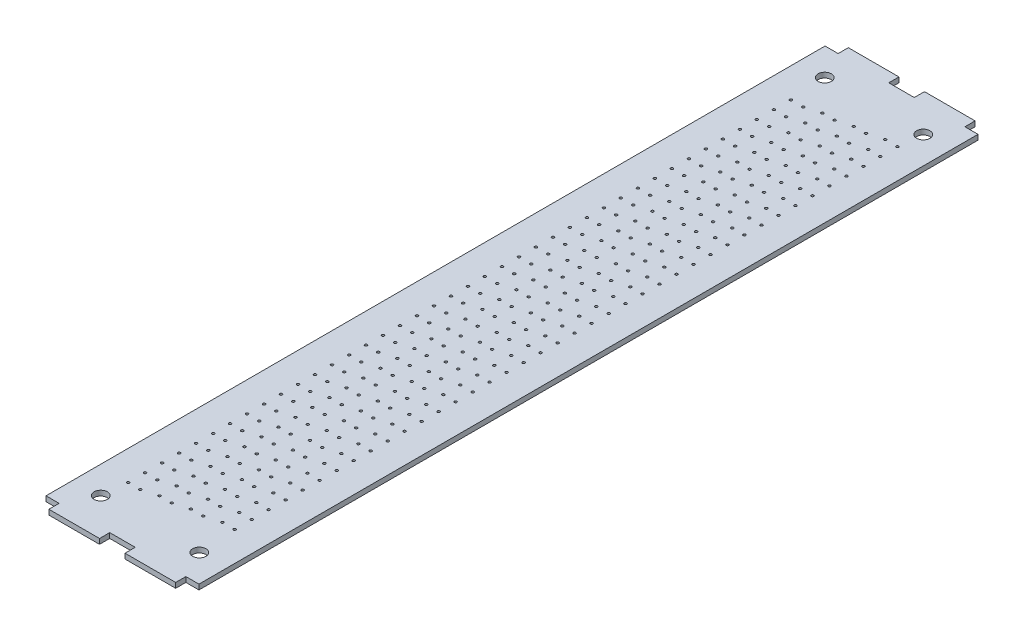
from build123d import *

# Parameters (mm, degrees)
CROQUIS1_R              = 3.9
CROQUIS1_R_2            = 0.75
SALIENTE_EXTRUIR1_DEPTH = 3


with BuildPart() as part:
    # Croquis1 → Saliente-Extruir1 (new body)
    with BuildSketch(Plane(origin=(0, 0, 0), x_dir=(1, 0, 0), z_dir=(0, 1, 0))):
        Polygon((0, 0), (7.7, 0), (7.7, -6), (37.5, -6), (37.5, 0), (52.5, 0), (52.5, -6), (82.3, -6), (82.3, 0), (90, 0), (90, 458.4), (82.3, 458.4), (82.3, 464.4), (52.5, 464.4), (52.5, 458.4), (37.5, 458.4), (37.5, 464.4), (7.7, 464.4), (7.7, 458.4), (0, 458.4), align=None)
        with Locations(Location((16, 442.2, 0), (0, 0, 270))):
            Circle(CROQUIS1_R, mode=Mode.SUBTRACT)
        with Locations(Location((74, 442.2, 0), (0, 0, 270))):
            Circle(CROQUIS1_R, mode=Mode.SUBTRACT)
        with Locations(Location((16, 16.2, 0), (0, 0, 270))):
            Circle(CROQUIS1_R, mode=Mode.SUBTRACT)
        with Locations(Location((74, 16.2, 0), (0, 0, 270))):
            Circle(CROQUIS1_R, mode=Mode.SUBTRACT)
        with Locations(Location((72.6, 38.4, 0), (0, 0, 270))):
            Circle(CROQUIS1_R_2, mode=Mode.SUBTRACT)
        with Locations(Location((65.4, 38.4, 0), (0, 0, 270))):
            Circle(CROQUIS1_R_2, mode=Mode.SUBTRACT)
        with Locations(Location((56.6, 35.9, 0), (0, 0, 270))):
            Circle(CROQUIS1_R_2, mode=Mode.SUBTRACT)
        with Locations(Location((49.4, 35.9, 0), (0, 0, 270))):
            Circle(CROQUIS1_R_2, mode=Mode.SUBTRACT)
        with Locations(Location((40.6, 33.4, 0), (0, 0, 270))):
            Circle(CROQUIS1_R_2, mode=Mode.SUBTRACT)
        with Locations(Location((33.4, 33.4, 0), (0, 0, 270))):
            Circle(CROQUIS1_R_2, mode=Mode.SUBTRACT)
        with Locations(Location((24.6, 30.9, 0), (0, 0, 270))):
            Circle(CROQUIS1_R_2, mode=Mode.SUBTRACT)
        with Locations(Location((17.4, 30.9, 0), (0, 0, 270))):
            Circle(CROQUIS1_R_2, mode=Mode.SUBTRACT)
        with Locations(Location((17.4, 40.9, 0), (0, 0, 270))):
            Circle(CROQUIS1_R_2, mode=Mode.SUBTRACT)
        with Locations(Location((24.6, 40.9, 0), (0, 0, 270))):
            Circle(CROQUIS1_R_2, mode=Mode.SUBTRACT)
        with Locations(Location((33.4, 43.4, 0), (0, 0, 270))):
            Circle(CROQUIS1_R_2, mode=Mode.SUBTRACT)
        with Locations(Location((40.6, 43.4, 0), (0, 0, 270))):
            Circle(CROQUIS1_R_2, mode=Mode.SUBTRACT)
        with Locations(Location((49.4, 45.9, 0), (0, 0, 270))):
            Circle(CROQUIS1_R_2, mode=Mode.SUBTRACT)
        with Locations(Location((56.6, 45.9, 0), (0, 0, 270))):
            Circle(CROQUIS1_R_2, mode=Mode.SUBTRACT)
        with Locations(Location((65.4, 48.4, 0), (0, 0, 270))):
            Circle(CROQUIS1_R_2, mode=Mode.SUBTRACT)
        with Locations(Location((72.6, 48.4, 0), (0, 0, 270))):
            Circle(CROQUIS1_R_2, mode=Mode.SUBTRACT)
        with Locations(Location((17.4, 50.9, 0), (0, 0, 270))):
            Circle(CROQUIS1_R_2, mode=Mode.SUBTRACT)
        with Locations(Location((24.6, 50.9, 0), (0, 0, 270))):
            Circle(CROQUIS1_R_2, mode=Mode.SUBTRACT)
        with Locations(Location((33.4, 53.4, 0), (0, 0, 270))):
            Circle(CROQUIS1_R_2, mode=Mode.SUBTRACT)
        with Locations(Location((40.6, 53.4, 0), (0, 0, 270))):
            Circle(CROQUIS1_R_2, mode=Mode.SUBTRACT)
        with Locations(Location((49.4, 55.9, 0), (0, 0, 270))):
            Circle(CROQUIS1_R_2, mode=Mode.SUBTRACT)
        with Locations(Location((56.6, 55.9, 0), (0, 0, 270))):
            Circle(CROQUIS1_R_2, mode=Mode.SUBTRACT)
        with Locations(Location((65.4, 58.4, 0), (0, 0, 270))):
            Circle(CROQUIS1_R_2, mode=Mode.SUBTRACT)
        with Locations(Location((72.6, 58.4, 0), (0, 0, 270))):
            Circle(CROQUIS1_R_2, mode=Mode.SUBTRACT)
        with Locations(Location((17.4, 60.9, 0), (0, 0, 270))):
            Circle(CROQUIS1_R_2, mode=Mode.SUBTRACT)
        with Locations(Location((24.6, 60.9, 0), (0, 0, 270))):
            Circle(CROQUIS1_R_2, mode=Mode.SUBTRACT)
        with Locations(Location((33.4, 63.4, 0), (0, 0, 270))):
            Circle(CROQUIS1_R_2, mode=Mode.SUBTRACT)
        with Locations(Location((40.6, 63.4, 0), (0, 0, 270))):
            Circle(CROQUIS1_R_2, mode=Mode.SUBTRACT)
        with Locations(Location((49.4, 65.9, 0), (0, 0, 270))):
            Circle(CROQUIS1_R_2, mode=Mode.SUBTRACT)
        with Locations(Location((56.6, 65.9, 0), (0, 0, 270))):
            Circle(CROQUIS1_R_2, mode=Mode.SUBTRACT)
        with Locations(Location((65.4, 68.4, 0), (0, 0, 270))):
            Circle(CROQUIS1_R_2, mode=Mode.SUBTRACT)
        with Locations(Location((72.6, 68.4, 0), (0, 0, 270))):
            Circle(CROQUIS1_R_2, mode=Mode.SUBTRACT)
        with Locations(Location((17.4, 70.9, 0), (0, 0, 270))):
            Circle(CROQUIS1_R_2, mode=Mode.SUBTRACT)
        with Locations(Location((24.6, 70.9, 0), (0, 0, 270))):
            Circle(CROQUIS1_R_2, mode=Mode.SUBTRACT)
        with Locations(Location((33.4, 73.4, 0), (0, 0, 270))):
            Circle(CROQUIS1_R_2, mode=Mode.SUBTRACT)
        with Locations(Location((40.6, 73.4, 0), (0, 0, 270))):
            Circle(CROQUIS1_R_2, mode=Mode.SUBTRACT)
        with Locations(Location((49.4, 75.9, 0), (0, 0, 270))):
            Circle(CROQUIS1_R_2, mode=Mode.SUBTRACT)
        with Locations(Location((56.6, 75.9, 0), (0, 0, 270))):
            Circle(CROQUIS1_R_2, mode=Mode.SUBTRACT)
        with Locations(Location((65.4, 78.4, 0), (0, 0, 270))):
            Circle(CROQUIS1_R_2, mode=Mode.SUBTRACT)
        with Locations(Location((72.6, 78.4, 0), (0, 0, 270))):
            Circle(CROQUIS1_R_2, mode=Mode.SUBTRACT)
        with Locations(Location((17.4, 80.9, 0), (0, 0, 270))):
            Circle(CROQUIS1_R_2, mode=Mode.SUBTRACT)
        with Locations(Location((24.6, 80.9, 0), (0, 0, 270))):
            Circle(CROQUIS1_R_2, mode=Mode.SUBTRACT)
        with Locations(Location((33.4, 83.4, 0), (0, 0, 270))):
            Circle(CROQUIS1_R_2, mode=Mode.SUBTRACT)
        with Locations(Location((40.6, 83.4, 0), (0, 0, 270))):
            Circle(CROQUIS1_R_2, mode=Mode.SUBTRACT)
        with Locations(Location((49.4, 85.9, 0), (0, 0, 270))):
            Circle(CROQUIS1_R_2, mode=Mode.SUBTRACT)
        with Locations(Location((56.6, 85.9, 0), (0, 0, 270))):
            Circle(CROQUIS1_R_2, mode=Mode.SUBTRACT)
        with Locations(Location((65.4, 88.4, 0), (0, 0, 270))):
            Circle(CROQUIS1_R_2, mode=Mode.SUBTRACT)
        with Locations(Location((72.6, 88.4, 0), (0, 0, 270))):
            Circle(CROQUIS1_R_2, mode=Mode.SUBTRACT)
        with Locations(Location((17.4, 90.9, 0), (0, 0, 270))):
            Circle(CROQUIS1_R_2, mode=Mode.SUBTRACT)
        with Locations(Location((24.6, 90.9, 0), (0, 0, 270))):
            Circle(CROQUIS1_R_2, mode=Mode.SUBTRACT)
        with Locations(Location((33.4, 93.4, 0), (0, 0, 270))):
            Circle(CROQUIS1_R_2, mode=Mode.SUBTRACT)
        with Locations(Location((40.6, 93.4, 0), (0, 0, 270))):
            Circle(CROQUIS1_R_2, mode=Mode.SUBTRACT)
        with Locations(Location((49.4, 95.9, 0), (0, 0, 270))):
            Circle(CROQUIS1_R_2, mode=Mode.SUBTRACT)
        with Locations(Location((56.6, 95.9, 0), (0, 0, 270))):
            Circle(CROQUIS1_R_2, mode=Mode.SUBTRACT)
        with Locations(Location((65.4, 98.4, 0), (0, 0, 270))):
            Circle(CROQUIS1_R_2, mode=Mode.SUBTRACT)
        with Locations(Location((72.6, 98.4, 0), (0, 0, 270))):
            Circle(CROQUIS1_R_2, mode=Mode.SUBTRACT)
        with Locations(Location((17.4, 100.9, 0), (0, 0, 270))):
            Circle(CROQUIS1_R_2, mode=Mode.SUBTRACT)
        with Locations(Location((24.6, 100.9, 0), (0, 0, 270))):
            Circle(CROQUIS1_R_2, mode=Mode.SUBTRACT)
        with Locations(Location((33.4, 103.4, 0), (0, 0, 270))):
            Circle(CROQUIS1_R_2, mode=Mode.SUBTRACT)
        with Locations(Location((40.6, 103.4, 0), (0, 0, 270))):
            Circle(CROQUIS1_R_2, mode=Mode.SUBTRACT)
        with Locations(Location((49.4, 105.9, 0), (0, 0, 270))):
            Circle(CROQUIS1_R_2, mode=Mode.SUBTRACT)
        with Locations(Location((56.6, 105.9, 0), (0, 0, 270))):
            Circle(CROQUIS1_R_2, mode=Mode.SUBTRACT)
        with Locations(Location((65.4, 108.4, 0), (0, 0, 270))):
            Circle(CROQUIS1_R_2, mode=Mode.SUBTRACT)
        with Locations(Location((72.6, 108.4, 0), (0, 0, 270))):
            Circle(CROQUIS1_R_2, mode=Mode.SUBTRACT)
        with Locations(Location((17.4, 110.9, 0), (0, 0, 270))):
            Circle(CROQUIS1_R_2, mode=Mode.SUBTRACT)
        with Locations(Location((24.6, 110.9, 0), (0, 0, 270))):
            Circle(CROQUIS1_R_2, mode=Mode.SUBTRACT)
        with Locations(Location((33.4, 113.4, 0), (0, 0, 270))):
            Circle(CROQUIS1_R_2, mode=Mode.SUBTRACT)
        with Locations(Location((40.6, 113.4, 0), (0, 0, 270))):
            Circle(CROQUIS1_R_2, mode=Mode.SUBTRACT)
        with Locations(Location((49.4, 115.9, 0), (0, 0, 270))):
            Circle(CROQUIS1_R_2, mode=Mode.SUBTRACT)
        with Locations(Location((56.6, 115.9, 0), (0, 0, 270))):
            Circle(CROQUIS1_R_2, mode=Mode.SUBTRACT)
        with Locations(Location((65.4, 118.4, 0), (0, 0, 270))):
            Circle(CROQUIS1_R_2, mode=Mode.SUBTRACT)
        with Locations(Location((72.6, 118.4, 0), (0, 0, 270))):
            Circle(CROQUIS1_R_2, mode=Mode.SUBTRACT)
        with Locations(Location((17.4, 120.9, 0), (0, 0, 270))):
            Circle(CROQUIS1_R_2, mode=Mode.SUBTRACT)
        with Locations(Location((24.6, 120.9, 0), (0, 0, 270))):
            Circle(CROQUIS1_R_2, mode=Mode.SUBTRACT)
        with Locations(Location((33.4, 123.4, 0), (0, 0, 270))):
            Circle(CROQUIS1_R_2, mode=Mode.SUBTRACT)
        with Locations(Location((40.6, 123.4, 0), (0, 0, 270))):
            Circle(CROQUIS1_R_2, mode=Mode.SUBTRACT)
        with Locations(Location((49.4, 125.9, 0), (0, 0, 270))):
            Circle(CROQUIS1_R_2, mode=Mode.SUBTRACT)
        with Locations(Location((56.6, 125.9, 0), (0, 0, 270))):
            Circle(CROQUIS1_R_2, mode=Mode.SUBTRACT)
        with Locations(Location((65.4, 128.4, 0), (0, 0, 270))):
            Circle(CROQUIS1_R_2, mode=Mode.SUBTRACT)
        with Locations(Location((72.6, 128.4, 0), (0, 0, 270))):
            Circle(CROQUIS1_R_2, mode=Mode.SUBTRACT)
        with Locations(Location((17.4, 130.9, 0), (0, 0, 270))):
            Circle(CROQUIS1_R_2, mode=Mode.SUBTRACT)
        with Locations(Location((24.6, 130.9, 0), (0, 0, 270))):
            Circle(CROQUIS1_R_2, mode=Mode.SUBTRACT)
        with Locations(Location((33.4, 133.4, 0), (0, 0, 270))):
            Circle(CROQUIS1_R_2, mode=Mode.SUBTRACT)
        with Locations(Location((40.6, 133.4, 0), (0, 0, 270))):
            Circle(CROQUIS1_R_2, mode=Mode.SUBTRACT)
        with Locations(Location((49.4, 135.9, 0), (0, 0, 270))):
            Circle(CROQUIS1_R_2, mode=Mode.SUBTRACT)
        with Locations(Location((56.6, 135.9, 0), (0, 0, 270))):
            Circle(CROQUIS1_R_2, mode=Mode.SUBTRACT)
        with Locations(Location((65.4, 138.4, 0), (0, 0, 270))):
            Circle(CROQUIS1_R_2, mode=Mode.SUBTRACT)
        with Locations(Location((72.6, 138.4, 0), (0, 0, 270))):
            Circle(CROQUIS1_R_2, mode=Mode.SUBTRACT)
        with Locations(Location((17.4, 140.9, 0), (0, 0, 270))):
            Circle(CROQUIS1_R_2, mode=Mode.SUBTRACT)
        with Locations(Location((24.6, 140.9, 0), (0, 0, 270))):
            Circle(CROQUIS1_R_2, mode=Mode.SUBTRACT)
        with Locations(Location((33.4, 143.4, 0), (0, 0, 270))):
            Circle(CROQUIS1_R_2, mode=Mode.SUBTRACT)
        with Locations(Location((40.6, 143.4, 0), (0, 0, 270))):
            Circle(CROQUIS1_R_2, mode=Mode.SUBTRACT)
        with Locations(Location((49.4, 145.9, 0), (0, 0, 270))):
            Circle(CROQUIS1_R_2, mode=Mode.SUBTRACT)
        with Locations(Location((56.6, 145.9, 0), (0, 0, 270))):
            Circle(CROQUIS1_R_2, mode=Mode.SUBTRACT)
        with Locations(Location((65.4, 148.4, 0), (0, 0, 270))):
            Circle(CROQUIS1_R_2, mode=Mode.SUBTRACT)
        with Locations(Location((72.6, 148.4, 0), (0, 0, 270))):
            Circle(CROQUIS1_R_2, mode=Mode.SUBTRACT)
        with Locations(Location((17.4, 150.9, 0), (0, 0, 270))):
            Circle(CROQUIS1_R_2, mode=Mode.SUBTRACT)
        with Locations(Location((24.6, 150.9, 0), (0, 0, 270))):
            Circle(CROQUIS1_R_2, mode=Mode.SUBTRACT)
        with Locations(Location((33.4, 153.4, 0), (0, 0, 270))):
            Circle(CROQUIS1_R_2, mode=Mode.SUBTRACT)
        with Locations(Location((40.6, 153.4, 0), (0, 0, 270))):
            Circle(CROQUIS1_R_2, mode=Mode.SUBTRACT)
        with Locations(Location((49.4, 155.9, 0), (0, 0, 270))):
            Circle(CROQUIS1_R_2, mode=Mode.SUBTRACT)
        with Locations(Location((56.6, 155.9, 0), (0, 0, 270))):
            Circle(CROQUIS1_R_2, mode=Mode.SUBTRACT)
        with Locations(Location((65.4, 158.4, 0), (0, 0, 270))):
            Circle(CROQUIS1_R_2, mode=Mode.SUBTRACT)
        with Locations(Location((72.6, 158.4, 0), (0, 0, 270))):
            Circle(CROQUIS1_R_2, mode=Mode.SUBTRACT)
        with Locations(Location((17.4, 160.9, 0), (0, 0, 270))):
            Circle(CROQUIS1_R_2, mode=Mode.SUBTRACT)
        with Locations(Location((24.6, 160.9, 0), (0, 0, 270))):
            Circle(CROQUIS1_R_2, mode=Mode.SUBTRACT)
        with Locations(Location((33.4, 163.4, 0), (0, 0, 270))):
            Circle(CROQUIS1_R_2, mode=Mode.SUBTRACT)
        with Locations(Location((40.6, 163.4, 0), (0, 0, 270))):
            Circle(CROQUIS1_R_2, mode=Mode.SUBTRACT)
        with Locations(Location((49.4, 165.9, 0), (0, 0, 270))):
            Circle(CROQUIS1_R_2, mode=Mode.SUBTRACT)
        with Locations(Location((56.6, 165.9, 0), (0, 0, 270))):
            Circle(CROQUIS1_R_2, mode=Mode.SUBTRACT)
        with Locations(Location((65.4, 168.4, 0), (0, 0, 270))):
            Circle(CROQUIS1_R_2, mode=Mode.SUBTRACT)
        with Locations(Location((72.6, 168.4, 0), (0, 0, 270))):
            Circle(CROQUIS1_R_2, mode=Mode.SUBTRACT)
        with Locations(Location((17.4, 170.9, 0), (0, 0, 270))):
            Circle(CROQUIS1_R_2, mode=Mode.SUBTRACT)
        with Locations(Location((24.6, 170.9, 0), (0, 0, 270))):
            Circle(CROQUIS1_R_2, mode=Mode.SUBTRACT)
        with Locations(Location((33.4, 173.4, 0), (0, 0, 270))):
            Circle(CROQUIS1_R_2, mode=Mode.SUBTRACT)
        with Locations(Location((40.6, 173.4, 0), (0, 0, 270))):
            Circle(CROQUIS1_R_2, mode=Mode.SUBTRACT)
        with Locations(Location((49.4, 175.9, 0), (0, 0, 270))):
            Circle(CROQUIS1_R_2, mode=Mode.SUBTRACT)
        with Locations(Location((56.6, 175.9, 0), (0, 0, 270))):
            Circle(CROQUIS1_R_2, mode=Mode.SUBTRACT)
        with Locations(Location((65.4, 178.4, 0), (0, 0, 270))):
            Circle(CROQUIS1_R_2, mode=Mode.SUBTRACT)
        with Locations(Location((72.6, 178.4, 0), (0, 0, 270))):
            Circle(CROQUIS1_R_2, mode=Mode.SUBTRACT)
        with Locations(Location((17.4, 180.9, 0), (0, 0, 270))):
            Circle(CROQUIS1_R_2, mode=Mode.SUBTRACT)
        with Locations(Location((24.6, 180.9, 0), (0, 0, 270))):
            Circle(CROQUIS1_R_2, mode=Mode.SUBTRACT)
        with Locations(Location((33.4, 183.4, 0), (0, 0, 270))):
            Circle(CROQUIS1_R_2, mode=Mode.SUBTRACT)
        with Locations(Location((40.6, 183.4, 0), (0, 0, 270))):
            Circle(CROQUIS1_R_2, mode=Mode.SUBTRACT)
        with Locations(Location((49.4, 185.9, 0), (0, 0, 270))):
            Circle(CROQUIS1_R_2, mode=Mode.SUBTRACT)
        with Locations(Location((56.6, 185.9, 0), (0, 0, 270))):
            Circle(CROQUIS1_R_2, mode=Mode.SUBTRACT)
        with Locations(Location((65.4, 188.4, 0), (0, 0, 270))):
            Circle(CROQUIS1_R_2, mode=Mode.SUBTRACT)
        with Locations(Location((72.6, 188.4, 0), (0, 0, 270))):
            Circle(CROQUIS1_R_2, mode=Mode.SUBTRACT)
        with Locations(Location((17.4, 190.9, 0), (0, 0, 270))):
            Circle(CROQUIS1_R_2, mode=Mode.SUBTRACT)
        with Locations(Location((24.6, 190.9, 0), (0, 0, 270))):
            Circle(CROQUIS1_R_2, mode=Mode.SUBTRACT)
        with Locations(Location((33.4, 193.4, 0), (0, 0, 270))):
            Circle(CROQUIS1_R_2, mode=Mode.SUBTRACT)
        with Locations(Location((40.6, 193.4, 0), (0, 0, 270))):
            Circle(CROQUIS1_R_2, mode=Mode.SUBTRACT)
        with Locations(Location((49.4, 195.9, 0), (0, 0, 270))):
            Circle(CROQUIS1_R_2, mode=Mode.SUBTRACT)
        with Locations(Location((56.6, 195.9, 0), (0, 0, 270))):
            Circle(CROQUIS1_R_2, mode=Mode.SUBTRACT)
        with Locations(Location((65.4, 198.4, 0), (0, 0, 270))):
            Circle(CROQUIS1_R_2, mode=Mode.SUBTRACT)
        with Locations(Location((72.6, 198.4, 0), (0, 0, 270))):
            Circle(CROQUIS1_R_2, mode=Mode.SUBTRACT)
        with Locations(Location((17.4, 200.9, 0), (0, 0, 270))):
            Circle(CROQUIS1_R_2, mode=Mode.SUBTRACT)
        with Locations(Location((24.6, 200.9, 0), (0, 0, 270))):
            Circle(CROQUIS1_R_2, mode=Mode.SUBTRACT)
        with Locations(Location((33.4, 203.4, 0), (0, 0, 270))):
            Circle(CROQUIS1_R_2, mode=Mode.SUBTRACT)
        with Locations(Location((40.6, 203.4, 0), (0, 0, 270))):
            Circle(CROQUIS1_R_2, mode=Mode.SUBTRACT)
        with Locations(Location((49.4, 205.9, 0), (0, 0, 270))):
            Circle(CROQUIS1_R_2, mode=Mode.SUBTRACT)
        with Locations(Location((56.6, 205.9, 0), (0, 0, 270))):
            Circle(CROQUIS1_R_2, mode=Mode.SUBTRACT)
        with Locations(Location((65.4, 208.4, 0), (0, 0, 270))):
            Circle(CROQUIS1_R_2, mode=Mode.SUBTRACT)
        with Locations(Location((72.6, 208.4, 0), (0, 0, 270))):
            Circle(CROQUIS1_R_2, mode=Mode.SUBTRACT)
        with Locations(Location((17.4, 210.9, 0), (0, 0, 270))):
            Circle(CROQUIS1_R_2, mode=Mode.SUBTRACT)
        with Locations(Location((24.6, 210.9, 0), (0, 0, 270))):
            Circle(CROQUIS1_R_2, mode=Mode.SUBTRACT)
        with Locations(Location((33.4, 213.4, 0), (0, 0, 270))):
            Circle(CROQUIS1_R_2, mode=Mode.SUBTRACT)
        with Locations(Location((40.6, 213.4, 0), (0, 0, 270))):
            Circle(CROQUIS1_R_2, mode=Mode.SUBTRACT)
        with Locations(Location((49.4, 215.9, 0), (0, 0, 270))):
            Circle(CROQUIS1_R_2, mode=Mode.SUBTRACT)
        with Locations(Location((56.6, 215.9, 0), (0, 0, 270))):
            Circle(CROQUIS1_R_2, mode=Mode.SUBTRACT)
        with Locations(Location((65.4, 218.4, 0), (0, 0, 270))):
            Circle(CROQUIS1_R_2, mode=Mode.SUBTRACT)
        with Locations(Location((72.6, 218.4, 0), (0, 0, 270))):
            Circle(CROQUIS1_R_2, mode=Mode.SUBTRACT)
        with Locations(Location((17.4, 220.9, 0), (0, 0, 270))):
            Circle(CROQUIS1_R_2, mode=Mode.SUBTRACT)
        with Locations(Location((24.6, 220.9, 0), (0, 0, 270))):
            Circle(CROQUIS1_R_2, mode=Mode.SUBTRACT)
        with Locations(Location((33.4, 223.4, 0), (0, 0, 270))):
            Circle(CROQUIS1_R_2, mode=Mode.SUBTRACT)
        with Locations(Location((40.6, 223.4, 0), (0, 0, 270))):
            Circle(CROQUIS1_R_2, mode=Mode.SUBTRACT)
        with Locations(Location((49.4, 225.9, 0), (0, 0, 270))):
            Circle(CROQUIS1_R_2, mode=Mode.SUBTRACT)
        with Locations(Location((56.6, 225.9, 0), (0, 0, 270))):
            Circle(CROQUIS1_R_2, mode=Mode.SUBTRACT)
        with Locations(Location((65.4, 228.4, 0), (0, 0, 270))):
            Circle(CROQUIS1_R_2, mode=Mode.SUBTRACT)
        with Locations(Location((72.6, 228.4, 0), (0, 0, 270))):
            Circle(CROQUIS1_R_2, mode=Mode.SUBTRACT)
        with Locations(Location((17.4, 230.9, 0), (0, 0, 270))):
            Circle(CROQUIS1_R_2, mode=Mode.SUBTRACT)
        with Locations(Location((24.6, 230.9, 0), (0, 0, 270))):
            Circle(CROQUIS1_R_2, mode=Mode.SUBTRACT)
        with Locations(Location((33.4, 233.4, 0), (0, 0, 270))):
            Circle(CROQUIS1_R_2, mode=Mode.SUBTRACT)
        with Locations(Location((40.6, 233.4, 0), (0, 0, 270))):
            Circle(CROQUIS1_R_2, mode=Mode.SUBTRACT)
        with Locations(Location((49.4, 235.9, 0), (0, 0, 270))):
            Circle(CROQUIS1_R_2, mode=Mode.SUBTRACT)
        with Locations(Location((56.6, 235.9, 0), (0, 0, 270))):
            Circle(CROQUIS1_R_2, mode=Mode.SUBTRACT)
        with Locations(Location((65.4, 238.4, 0), (0, 0, 270))):
            Circle(CROQUIS1_R_2, mode=Mode.SUBTRACT)
        with Locations(Location((72.6, 238.4, 0), (0, 0, 270))):
            Circle(CROQUIS1_R_2, mode=Mode.SUBTRACT)
        with Locations(Location((17.4, 240.9, 0), (0, 0, 270))):
            Circle(CROQUIS1_R_2, mode=Mode.SUBTRACT)
        with Locations(Location((24.6, 240.9, 0), (0, 0, 270))):
            Circle(CROQUIS1_R_2, mode=Mode.SUBTRACT)
        with Locations(Location((33.4, 243.4, 0), (0, 0, 270))):
            Circle(CROQUIS1_R_2, mode=Mode.SUBTRACT)
        with Locations(Location((40.6, 243.4, 0), (0, 0, 270))):
            Circle(CROQUIS1_R_2, mode=Mode.SUBTRACT)
        with Locations(Location((49.4, 245.9, 0), (0, 0, 270))):
            Circle(CROQUIS1_R_2, mode=Mode.SUBTRACT)
        with Locations(Location((56.6, 245.9, 0), (0, 0, 270))):
            Circle(CROQUIS1_R_2, mode=Mode.SUBTRACT)
        with Locations(Location((65.4, 248.4, 0), (0, 0, 270))):
            Circle(CROQUIS1_R_2, mode=Mode.SUBTRACT)
        with Locations(Location((72.6, 248.4, 0), (0, 0, 270))):
            Circle(CROQUIS1_R_2, mode=Mode.SUBTRACT)
        with Locations(Location((17.4, 250.9, 0), (0, 0, 270))):
            Circle(CROQUIS1_R_2, mode=Mode.SUBTRACT)
        with Locations(Location((24.6, 250.9, 0), (0, 0, 270))):
            Circle(CROQUIS1_R_2, mode=Mode.SUBTRACT)
        with Locations(Location((33.4, 253.4, 0), (0, 0, 270))):
            Circle(CROQUIS1_R_2, mode=Mode.SUBTRACT)
        with Locations(Location((40.6, 253.4, 0), (0, 0, 270))):
            Circle(CROQUIS1_R_2, mode=Mode.SUBTRACT)
        with Locations(Location((49.4, 255.9, 0), (0, 0, 270))):
            Circle(CROQUIS1_R_2, mode=Mode.SUBTRACT)
        with Locations(Location((56.6, 255.9, 0), (0, 0, 270))):
            Circle(CROQUIS1_R_2, mode=Mode.SUBTRACT)
        with Locations(Location((65.4, 258.4, 0), (0, 0, 270))):
            Circle(CROQUIS1_R_2, mode=Mode.SUBTRACT)
        with Locations(Location((72.6, 258.4, 0), (0, 0, 270))):
            Circle(CROQUIS1_R_2, mode=Mode.SUBTRACT)
        with Locations(Location((17.4, 260.9, 0), (0, 0, 270))):
            Circle(CROQUIS1_R_2, mode=Mode.SUBTRACT)
        with Locations(Location((24.6, 260.9, 0), (0, 0, 270))):
            Circle(CROQUIS1_R_2, mode=Mode.SUBTRACT)
        with Locations(Location((33.4, 263.4, 0), (0, 0, 270))):
            Circle(CROQUIS1_R_2, mode=Mode.SUBTRACT)
        with Locations(Location((40.6, 263.4, 0), (0, 0, 270))):
            Circle(CROQUIS1_R_2, mode=Mode.SUBTRACT)
        with Locations(Location((49.4, 265.9, 0), (0, 0, 270))):
            Circle(CROQUIS1_R_2, mode=Mode.SUBTRACT)
        with Locations(Location((56.6, 265.9, 0), (0, 0, 270))):
            Circle(CROQUIS1_R_2, mode=Mode.SUBTRACT)
        with Locations(Location((65.4, 268.4, 0), (0, 0, 270))):
            Circle(CROQUIS1_R_2, mode=Mode.SUBTRACT)
        with Locations(Location((72.6, 268.4, 0), (0, 0, 270))):
            Circle(CROQUIS1_R_2, mode=Mode.SUBTRACT)
        with Locations(Location((17.4, 270.9, 0), (0, 0, 270))):
            Circle(CROQUIS1_R_2, mode=Mode.SUBTRACT)
        with Locations(Location((24.6, 270.9, 0), (0, 0, 270))):
            Circle(CROQUIS1_R_2, mode=Mode.SUBTRACT)
        with Locations(Location((33.4, 273.4, 0), (0, 0, 270))):
            Circle(CROQUIS1_R_2, mode=Mode.SUBTRACT)
        with Locations(Location((40.6, 273.4, 0), (0, 0, 270))):
            Circle(CROQUIS1_R_2, mode=Mode.SUBTRACT)
        with Locations(Location((49.4, 275.9, 0), (0, 0, 270))):
            Circle(CROQUIS1_R_2, mode=Mode.SUBTRACT)
        with Locations(Location((56.6, 275.9, 0), (0, 0, 270))):
            Circle(CROQUIS1_R_2, mode=Mode.SUBTRACT)
        with Locations(Location((65.4, 278.4, 0), (0, 0, 270))):
            Circle(CROQUIS1_R_2, mode=Mode.SUBTRACT)
        with Locations(Location((72.6, 278.4, 0), (0, 0, 270))):
            Circle(CROQUIS1_R_2, mode=Mode.SUBTRACT)
        with Locations(Location((17.4, 280.9, 0), (0, 0, 270))):
            Circle(CROQUIS1_R_2, mode=Mode.SUBTRACT)
        with Locations(Location((24.6, 280.9, 0), (0, 0, 270))):
            Circle(CROQUIS1_R_2, mode=Mode.SUBTRACT)
        with Locations(Location((33.4, 283.4, 0), (0, 0, 270))):
            Circle(CROQUIS1_R_2, mode=Mode.SUBTRACT)
        with Locations(Location((40.6, 283.4, 0), (0, 0, 270))):
            Circle(CROQUIS1_R_2, mode=Mode.SUBTRACT)
        with Locations(Location((49.4, 285.9, 0), (0, 0, 270))):
            Circle(CROQUIS1_R_2, mode=Mode.SUBTRACT)
        with Locations(Location((56.6, 285.9, 0), (0, 0, 270))):
            Circle(CROQUIS1_R_2, mode=Mode.SUBTRACT)
        with Locations(Location((65.4, 288.4, 0), (0, 0, 270))):
            Circle(CROQUIS1_R_2, mode=Mode.SUBTRACT)
        with Locations(Location((72.6, 288.4, 0), (0, 0, 270))):
            Circle(CROQUIS1_R_2, mode=Mode.SUBTRACT)
        with Locations(Location((17.4, 290.9, 0), (0, 0, 270))):
            Circle(CROQUIS1_R_2, mode=Mode.SUBTRACT)
        with Locations(Location((24.6, 290.9, 0), (0, 0, 270))):
            Circle(CROQUIS1_R_2, mode=Mode.SUBTRACT)
        with Locations(Location((33.4, 293.4, 0), (0, 0, 270))):
            Circle(CROQUIS1_R_2, mode=Mode.SUBTRACT)
        with Locations(Location((40.6, 293.4, 0), (0, 0, 270))):
            Circle(CROQUIS1_R_2, mode=Mode.SUBTRACT)
        with Locations(Location((49.4, 295.9, 0), (0, 0, 270))):
            Circle(CROQUIS1_R_2, mode=Mode.SUBTRACT)
        with Locations(Location((56.6, 295.9, 0), (0, 0, 270))):
            Circle(CROQUIS1_R_2, mode=Mode.SUBTRACT)
        with Locations(Location((65.4, 298.4, 0), (0, 0, 270))):
            Circle(CROQUIS1_R_2, mode=Mode.SUBTRACT)
        with Locations(Location((72.6, 298.4, 0), (0, 0, 270))):
            Circle(CROQUIS1_R_2, mode=Mode.SUBTRACT)
        with Locations(Location((17.4, 300.9, 0), (0, 0, 270))):
            Circle(CROQUIS1_R_2, mode=Mode.SUBTRACT)
        with Locations(Location((24.6, 300.9, 0), (0, 0, 270))):
            Circle(CROQUIS1_R_2, mode=Mode.SUBTRACT)
        with Locations(Location((33.4, 303.4, 0), (0, 0, 270))):
            Circle(CROQUIS1_R_2, mode=Mode.SUBTRACT)
        with Locations(Location((40.6, 303.4, 0), (0, 0, 270))):
            Circle(CROQUIS1_R_2, mode=Mode.SUBTRACT)
        with Locations(Location((49.4, 305.9, 0), (0, 0, 270))):
            Circle(CROQUIS1_R_2, mode=Mode.SUBTRACT)
        with Locations(Location((56.6, 305.9, 0), (0, 0, 270))):
            Circle(CROQUIS1_R_2, mode=Mode.SUBTRACT)
        with Locations(Location((65.4, 308.4, 0), (0, 0, 270))):
            Circle(CROQUIS1_R_2, mode=Mode.SUBTRACT)
        with Locations(Location((72.6, 308.4, 0), (0, 0, 270))):
            Circle(CROQUIS1_R_2, mode=Mode.SUBTRACT)
        with Locations(Location((17.4, 310.9, 0), (0, 0, 270))):
            Circle(CROQUIS1_R_2, mode=Mode.SUBTRACT)
        with Locations(Location((24.6, 310.9, 0), (0, 0, 270))):
            Circle(CROQUIS1_R_2, mode=Mode.SUBTRACT)
        with Locations(Location((33.4, 313.4, 0), (0, 0, 270))):
            Circle(CROQUIS1_R_2, mode=Mode.SUBTRACT)
        with Locations(Location((40.6, 313.4, 0), (0, 0, 270))):
            Circle(CROQUIS1_R_2, mode=Mode.SUBTRACT)
        with Locations(Location((49.4, 315.9, 0), (0, 0, 270))):
            Circle(CROQUIS1_R_2, mode=Mode.SUBTRACT)
        with Locations(Location((56.6, 315.9, 0), (0, 0, 270))):
            Circle(CROQUIS1_R_2, mode=Mode.SUBTRACT)
        with Locations(Location((65.4, 318.4, 0), (0, 0, 270))):
            Circle(CROQUIS1_R_2, mode=Mode.SUBTRACT)
        with Locations(Location((72.6, 318.4, 0), (0, 0, 270))):
            Circle(CROQUIS1_R_2, mode=Mode.SUBTRACT)
        with Locations(Location((17.4, 320.9, 0), (0, 0, 270))):
            Circle(CROQUIS1_R_2, mode=Mode.SUBTRACT)
        with Locations(Location((24.6, 320.9, 0), (0, 0, 270))):
            Circle(CROQUIS1_R_2, mode=Mode.SUBTRACT)
        with Locations(Location((33.4, 323.4, 0), (0, 0, 270))):
            Circle(CROQUIS1_R_2, mode=Mode.SUBTRACT)
        with Locations(Location((40.6, 323.4, 0), (0, 0, 270))):
            Circle(CROQUIS1_R_2, mode=Mode.SUBTRACT)
        with Locations(Location((49.4, 325.9, 0), (0, 0, 270))):
            Circle(CROQUIS1_R_2, mode=Mode.SUBTRACT)
        with Locations(Location((56.6, 325.9, 0), (0, 0, 270))):
            Circle(CROQUIS1_R_2, mode=Mode.SUBTRACT)
        with Locations(Location((65.4, 328.4, 0), (0, 0, 270))):
            Circle(CROQUIS1_R_2, mode=Mode.SUBTRACT)
        with Locations(Location((72.6, 328.4, 0), (0, 0, 270))):
            Circle(CROQUIS1_R_2, mode=Mode.SUBTRACT)
        with Locations(Location((17.4, 330.9, 0), (0, 0, 270))):
            Circle(CROQUIS1_R_2, mode=Mode.SUBTRACT)
        with Locations(Location((24.6, 330.9, 0), (0, 0, 270))):
            Circle(CROQUIS1_R_2, mode=Mode.SUBTRACT)
        with Locations(Location((33.4, 333.4, 0), (0, 0, 270))):
            Circle(CROQUIS1_R_2, mode=Mode.SUBTRACT)
        with Locations(Location((40.6, 333.4, 0), (0, 0, 270))):
            Circle(CROQUIS1_R_2, mode=Mode.SUBTRACT)
        with Locations(Location((49.4, 335.9, 0), (0, 0, 270))):
            Circle(CROQUIS1_R_2, mode=Mode.SUBTRACT)
        with Locations(Location((56.6, 335.9, 0), (0, 0, 270))):
            Circle(CROQUIS1_R_2, mode=Mode.SUBTRACT)
        with Locations(Location((65.4, 338.4, 0), (0, 0, 270))):
            Circle(CROQUIS1_R_2, mode=Mode.SUBTRACT)
        with Locations(Location((72.6, 338.4, 0), (0, 0, 270))):
            Circle(CROQUIS1_R_2, mode=Mode.SUBTRACT)
        with Locations(Location((17.4, 340.9, 0), (0, 0, 270))):
            Circle(CROQUIS1_R_2, mode=Mode.SUBTRACT)
        with Locations(Location((24.6, 340.9, 0), (0, 0, 270))):
            Circle(CROQUIS1_R_2, mode=Mode.SUBTRACT)
        with Locations(Location((33.4, 343.4, 0), (0, 0, 270))):
            Circle(CROQUIS1_R_2, mode=Mode.SUBTRACT)
        with Locations(Location((40.6, 343.4, 0), (0, 0, 270))):
            Circle(CROQUIS1_R_2, mode=Mode.SUBTRACT)
        with Locations(Location((49.4, 345.9, 0), (0, 0, 270))):
            Circle(CROQUIS1_R_2, mode=Mode.SUBTRACT)
        with Locations(Location((56.6, 345.9, 0), (0, 0, 270))):
            Circle(CROQUIS1_R_2, mode=Mode.SUBTRACT)
        with Locations(Location((65.4, 348.4, 0), (0, 0, 270))):
            Circle(CROQUIS1_R_2, mode=Mode.SUBTRACT)
        with Locations(Location((72.6, 348.4, 0), (0, 0, 270))):
            Circle(CROQUIS1_R_2, mode=Mode.SUBTRACT)
        with Locations(Location((17.4, 350.9, 0), (0, 0, 270))):
            Circle(CROQUIS1_R_2, mode=Mode.SUBTRACT)
        with Locations(Location((24.6, 350.9, 0), (0, 0, 270))):
            Circle(CROQUIS1_R_2, mode=Mode.SUBTRACT)
        with Locations(Location((33.4, 353.4, 0), (0, 0, 270))):
            Circle(CROQUIS1_R_2, mode=Mode.SUBTRACT)
        with Locations(Location((40.6, 353.4, 0), (0, 0, 270))):
            Circle(CROQUIS1_R_2, mode=Mode.SUBTRACT)
        with Locations(Location((49.4, 355.9, 0), (0, 0, 270))):
            Circle(CROQUIS1_R_2, mode=Mode.SUBTRACT)
        with Locations(Location((56.6, 355.9, 0), (0, 0, 270))):
            Circle(CROQUIS1_R_2, mode=Mode.SUBTRACT)
        with Locations(Location((65.4, 358.4, 0), (0, 0, 270))):
            Circle(CROQUIS1_R_2, mode=Mode.SUBTRACT)
        with Locations(Location((72.6, 358.4, 0), (0, 0, 270))):
            Circle(CROQUIS1_R_2, mode=Mode.SUBTRACT)
        with Locations(Location((17.4, 360.9, 0), (0, 0, 270))):
            Circle(CROQUIS1_R_2, mode=Mode.SUBTRACT)
        with Locations(Location((24.6, 360.9, 0), (0, 0, 270))):
            Circle(CROQUIS1_R_2, mode=Mode.SUBTRACT)
        with Locations(Location((33.4, 363.4, 0), (0, 0, 270))):
            Circle(CROQUIS1_R_2, mode=Mode.SUBTRACT)
        with Locations(Location((40.6, 363.4, 0), (0, 0, 270))):
            Circle(CROQUIS1_R_2, mode=Mode.SUBTRACT)
        with Locations(Location((49.4, 365.9, 0), (0, 0, 270))):
            Circle(CROQUIS1_R_2, mode=Mode.SUBTRACT)
        with Locations(Location((56.6, 365.9, 0), (0, 0, 270))):
            Circle(CROQUIS1_R_2, mode=Mode.SUBTRACT)
        with Locations(Location((65.4, 368.4, 0), (0, 0, 270))):
            Circle(CROQUIS1_R_2, mode=Mode.SUBTRACT)
        with Locations(Location((72.6, 368.4, 0), (0, 0, 270))):
            Circle(CROQUIS1_R_2, mode=Mode.SUBTRACT)
        with Locations(Location((17.4, 370.9, 0), (0, 0, 270))):
            Circle(CROQUIS1_R_2, mode=Mode.SUBTRACT)
        with Locations(Location((24.6, 370.9, 0), (0, 0, 270))):
            Circle(CROQUIS1_R_2, mode=Mode.SUBTRACT)
        with Locations(Location((33.4, 373.4, 0), (0, 0, 270))):
            Circle(CROQUIS1_R_2, mode=Mode.SUBTRACT)
        with Locations(Location((40.6, 373.4, 0), (0, 0, 270))):
            Circle(CROQUIS1_R_2, mode=Mode.SUBTRACT)
        with Locations(Location((49.4, 375.9, 0), (0, 0, 270))):
            Circle(CROQUIS1_R_2, mode=Mode.SUBTRACT)
        with Locations(Location((56.6, 375.9, 0), (0, 0, 270))):
            Circle(CROQUIS1_R_2, mode=Mode.SUBTRACT)
        with Locations(Location((65.4, 378.4, 0), (0, 0, 270))):
            Circle(CROQUIS1_R_2, mode=Mode.SUBTRACT)
        with Locations(Location((72.6, 378.4, 0), (0, 0, 270))):
            Circle(CROQUIS1_R_2, mode=Mode.SUBTRACT)
        with Locations(Location((17.4, 380.9, 0), (0, 0, 270))):
            Circle(CROQUIS1_R_2, mode=Mode.SUBTRACT)
        with Locations(Location((24.6, 380.9, 0), (0, 0, 270))):
            Circle(CROQUIS1_R_2, mode=Mode.SUBTRACT)
        with Locations(Location((33.4, 383.4, 0), (0, 0, 270))):
            Circle(CROQUIS1_R_2, mode=Mode.SUBTRACT)
        with Locations(Location((40.6, 383.4, 0), (0, 0, 270))):
            Circle(CROQUIS1_R_2, mode=Mode.SUBTRACT)
        with Locations(Location((49.4, 385.9, 0), (0, 0, 270))):
            Circle(CROQUIS1_R_2, mode=Mode.SUBTRACT)
        with Locations(Location((56.6, 385.9, 0), (0, 0, 270))):
            Circle(CROQUIS1_R_2, mode=Mode.SUBTRACT)
        with Locations(Location((65.4, 388.4, 0), (0, 0, 270))):
            Circle(CROQUIS1_R_2, mode=Mode.SUBTRACT)
        with Locations(Location((72.6, 388.4, 0), (0, 0, 270))):
            Circle(CROQUIS1_R_2, mode=Mode.SUBTRACT)
        with Locations(Location((17.4, 390.9, 0), (0, 0, 270))):
            Circle(CROQUIS1_R_2, mode=Mode.SUBTRACT)
        with Locations(Location((24.6, 390.9, 0), (0, 0, 270))):
            Circle(CROQUIS1_R_2, mode=Mode.SUBTRACT)
        with Locations(Location((33.4, 393.4, 0), (0, 0, 270))):
            Circle(CROQUIS1_R_2, mode=Mode.SUBTRACT)
        with Locations(Location((40.6, 393.4, 0), (0, 0, 270))):
            Circle(CROQUIS1_R_2, mode=Mode.SUBTRACT)
        with Locations(Location((49.4, 395.9, 0), (0, 0, 270))):
            Circle(CROQUIS1_R_2, mode=Mode.SUBTRACT)
        with Locations(Location((56.6, 395.9, 0), (0, 0, 270))):
            Circle(CROQUIS1_R_2, mode=Mode.SUBTRACT)
        with Locations(Location((65.4, 398.4, 0), (0, 0, 270))):
            Circle(CROQUIS1_R_2, mode=Mode.SUBTRACT)
        with Locations(Location((72.6, 398.4, 0), (0, 0, 270))):
            Circle(CROQUIS1_R_2, mode=Mode.SUBTRACT)
        with Locations(Location((17.4, 400.9, 0), (0, 0, 270))):
            Circle(CROQUIS1_R_2, mode=Mode.SUBTRACT)
        with Locations(Location((24.6, 400.9, 0), (0, 0, 270))):
            Circle(CROQUIS1_R_2, mode=Mode.SUBTRACT)
        with Locations(Location((33.4, 403.4, 0), (0, 0, 270))):
            Circle(CROQUIS1_R_2, mode=Mode.SUBTRACT)
        with Locations(Location((40.6, 403.4, 0), (0, 0, 270))):
            Circle(CROQUIS1_R_2, mode=Mode.SUBTRACT)
        with Locations(Location((49.4, 405.9, 0), (0, 0, 270))):
            Circle(CROQUIS1_R_2, mode=Mode.SUBTRACT)
        with Locations(Location((56.6, 405.9, 0), (0, 0, 270))):
            Circle(CROQUIS1_R_2, mode=Mode.SUBTRACT)
        with Locations(Location((65.4, 408.4, 0), (0, 0, 270))):
            Circle(CROQUIS1_R_2, mode=Mode.SUBTRACT)
        with Locations(Location((72.6, 408.4, 0), (0, 0, 270))):
            Circle(CROQUIS1_R_2, mode=Mode.SUBTRACT)
        with Locations(Location((17.4, 410.9, 0), (0, 0, 270))):
            Circle(CROQUIS1_R_2, mode=Mode.SUBTRACT)
        with Locations(Location((24.6, 410.9, 0), (0, 0, 270))):
            Circle(CROQUIS1_R_2, mode=Mode.SUBTRACT)
        with Locations(Location((33.4, 413.4, 0), (0, 0, 270))):
            Circle(CROQUIS1_R_2, mode=Mode.SUBTRACT)
        with Locations(Location((40.6, 413.4, 0), (0, 0, 270))):
            Circle(CROQUIS1_R_2, mode=Mode.SUBTRACT)
        with Locations(Location((49.4, 415.9, 0), (0, 0, 270))):
            Circle(CROQUIS1_R_2, mode=Mode.SUBTRACT)
        with Locations(Location((56.6, 415.9, 0), (0, 0, 270))):
            Circle(CROQUIS1_R_2, mode=Mode.SUBTRACT)
        with Locations(Location((65.4, 418.4, 0), (0, 0, 270))):
            Circle(CROQUIS1_R_2, mode=Mode.SUBTRACT)
        with Locations(Location((72.6, 418.4, 0), (0, 0, 270))):
            Circle(CROQUIS1_R_2, mode=Mode.SUBTRACT)
        with Locations(Location((17.4, 420.9, 0), (0, 0, 270))):
            Circle(CROQUIS1_R_2, mode=Mode.SUBTRACT)
        with Locations(Location((24.6, 420.9, 0), (0, 0, 270))):
            Circle(CROQUIS1_R_2, mode=Mode.SUBTRACT)
        with Locations(Location((33.4, 423.4, 0), (0, 0, 270))):
            Circle(CROQUIS1_R_2, mode=Mode.SUBTRACT)
        with Locations(Location((40.6, 423.4, 0), (0, 0, 270))):
            Circle(CROQUIS1_R_2, mode=Mode.SUBTRACT)
        with Locations(Location((49.4, 425.9, 0), (0, 0, 270))):
            Circle(CROQUIS1_R_2, mode=Mode.SUBTRACT)
        with Locations(Location((56.6, 425.9, 0), (0, 0, 270))):
            Circle(CROQUIS1_R_2, mode=Mode.SUBTRACT)
        with Locations(Location((65.4, 428.4, 0), (0, 0, 270))):
            Circle(CROQUIS1_R_2, mode=Mode.SUBTRACT)
        with Locations(Location((72.6, 428.4, 0), (0, 0, 270))):
            Circle(CROQUIS1_R_2, mode=Mode.SUBTRACT)
    extrude(amount=SALIENTE_EXTRUIR1_DEPTH)


solid = part.part
